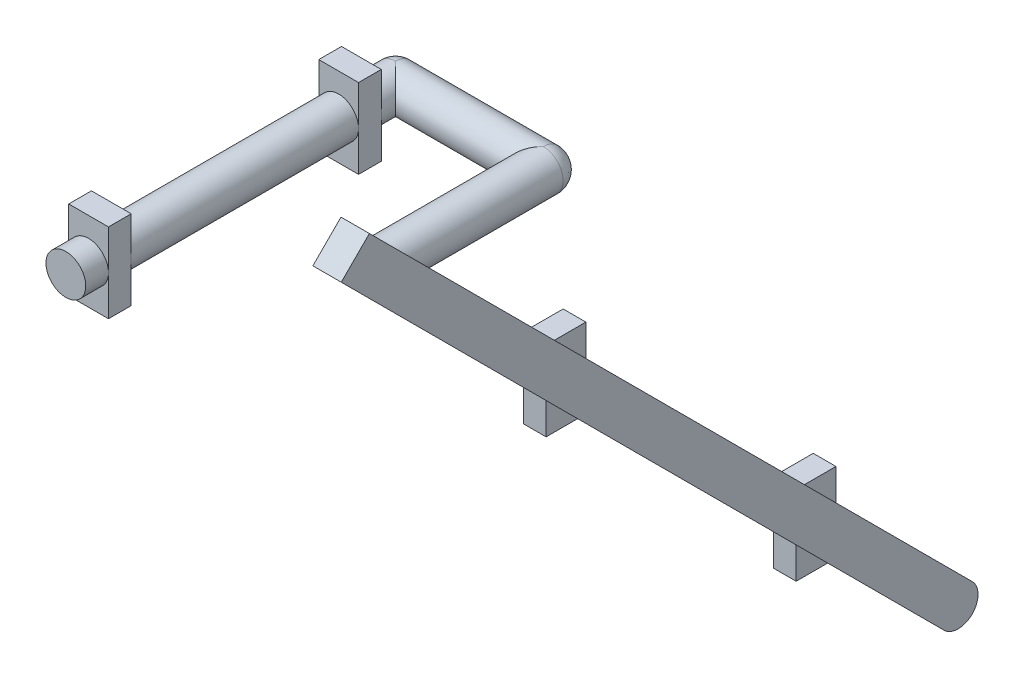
from build123d import *
from build123d.topology import SkipClean

# Parameters (mm, degrees)
ESQUISSE1_R       = 3.5
EXTRUSION1_DEPTH  = 20
ESQUISSE2_W       = 7
ESQUISSE2_H       = 14
EXTRUSION2_DEPTH  = 4
ESQUISSE3_R       = 3.5
EXTRUSION3_DEPTH  = 4
EXTRUSION4_START  = 6
ESQUISSE4_R       = 3.5
EXTRUSION4_DEPTH  = 6
ESQUISSE5_R       = 3.5
EXTRUSION5_DEPTH  = 26
ESQUISSE6_W       = 3.5
ESQUISSE6_H       = 30
ESQUISSE7_W       = 30
ESQUISSE7_H       = 3.5
ESQUISSE8_W       = 7
ESQUISSE8_H       = 14
EXTRUSION6_DEPTH  = 4
EXTRUSION7_DEPTH  = 40
EXTRUSION8_DEPTH  = 4
ESQUISSE11_R      = 3.5
EXTRUSION9_DEPTH  = 20
EXTRUSION10_DEPTH = 5


with BuildPart() as part:
    # Esquisse1 → Extrusion1 (new body)
    with BuildSketch(Plane.XY):
        Circle(ESQUISSE1_R)
    extrusion1 = extrude(amount=EXTRUSION1_DEPTH)

    # Esquisse2 → Extrusion2 (add)
    with BuildSketch(Plane.XY.offset(20)):
        Rectangle(ESQUISSE2_W, ESQUISSE2_H)
    extrusion2 = extrude(amount=EXTRUSION2_DEPTH)

    # Esquisse3 → Extrusion3 (add)
    with BuildSketch(Plane.XY.offset(24)):
        Circle(ESQUISSE3_R)
    extrude(amount=EXTRUSION3_DEPTH)

    # Sym_trie1: Extrusion1, Extrusion2 across plane
    add(extrusion1.mirror(Plane.XY))
    add(extrusion2.mirror(Plane.XY))

    # Esquisse4 → Extrusion4 (add)
    with BuildSketch(Plane(origin=(0, 0, -24), x_dir=(-1, 0, 0), z_dir=(0, 0, -1)).offset(EXTRUSION4_START)):
        Circle(ESQUISSE4_R)
    extrude(amount=-EXTRUSION4_DEPTH)

    # Esquisse5 → Extrusion5 (add)
    with BuildSketch(Plane(origin=(0, 0, 0), x_dir=(0, 0, -1), z_dir=(1, 0, 0))):
        with Locations(Location((30, 0, 0), (0, 0, 180))):
            Circle(ESQUISSE5_R)
    extrude(amount=EXTRUSION5_DEPTH)

    # Esquisse6 → R_volution1 (revolve)
    with BuildSketch(Plane(origin=(0, 0, 0), x_dir=(1, 0, 0), z_dir=(0, 1, 0)), mode=Mode.PRIVATE) as r_volution1_sk:
        with Locations((27.75, 15)):
            Rectangle(ESQUISSE6_W, ESQUISSE6_H)
    revolve(r_volution1_sk.sketch.rotate(Axis((26, 0, -30), (0, 0, 1)), 180), axis=Axis((26, 0, -30), (0, 0, 1)))

    # Esquisse7 → R_volution2 (revolve)
    with BuildSketch(Plane(origin=(0, 0, 0), x_dir=(1, 0, 0), z_dir=(0, 1, 0))):
        with Locations((41, -1.75)):
            Rectangle(ESQUISSE7_W, ESQUISSE7_H)
    revolve(axis=Axis((26, 0, 0), (1, 0, 0)))

    # Esquisse8 → Extrusion6 (add)
    with BuildSketch(Plane(origin=(56, 0, 0), x_dir=(0, 0, -1), z_dir=(1, 0, 0))):
        Rectangle(ESQUISSE8_W, ESQUISSE8_H)
    extrude(amount=EXTRUSION6_DEPTH)

    # Esquisse9 → Extrusion7 (add)
    with BuildSketch(Plane(origin=(60, 0, 0), x_dir=(0, 0, -1), z_dir=(1, 0, 0))):
        with BuildLine():
            ThreePointArc((-3.5, 0), (0, -3.5), (3.5, 0))
            ThreePointArc((3.5, 0), (0, 3.5), (-3.5, 0))
        make_face()
    extrude(amount=EXTRUSION7_DEPTH)

    # Esquisse10 → Extrusion8 (add)
    with BuildSketch(Plane(origin=(100, 0, 0), x_dir=(0, 0, -1), z_dir=(1, 0, 0))):
        Polygon((3.5, 0), (3.5, 7), (-3.5, 7), (-3.5, 0), (-3.5, -7), (3.5, -7), align=None)
    extrude(amount=EXTRUSION8_DEPTH)

    # Esquisse11 → Extrusion9 (add)
    with BuildSketch(Plane(origin=(104, 0, 0), x_dir=(0, 0, -1), z_dir=(1, 0, 0))):
        with Locations(Location((0, 0, 0), (0, 0, 180))):
            Circle(ESQUISSE11_R)
    extrude(amount=EXTRUSION9_DEPTH)

    # Esquisse12 → Extrusion10 (add)
    with SkipClean():  # the faces are left unmerged after this step: merging them gives an invalid solid
        with BuildSketch(Plane(origin=(124, 0, 0), x_dir=(0, 0, -1), z_dir=(1, 0, 0))):
            with BuildLine():
                Line((-103.591143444, 108.540890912), (2.474873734, 2.474873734))
                ThreePointArc((2.474873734, 2.474873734), (2.474873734, -2.474873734), (-2.474873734, -2.474873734))
                Line((-2.474873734, -2.474873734), (-108.540890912, 103.591143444))
                Line((-108.540890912, 103.591143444), (-103.591143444, 108.540890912))
            make_face()
        extrude(amount=EXTRUSION10_DEPTH)

    # Esquisse13 → R_volution3 (revolve)
    with SkipClean():  # the faces are left unmerged after this step: merging them gives an invalid solid
        with BuildSketch(Plane(origin=(0, 0, -30), x_dir=(-1, 0, 0), z_dir=(0, 0, -1))):
            with BuildLine():
                Line((0, 3.5), (0, -3.5))
                ThreePointArc((0, -3.5), (3.5, 0), (0, 3.5))
            make_face()
        revolve(axis=Axis((0, -11.338761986, -30), (0, 1, 0)))

    # Esquisse14 → R_volution4 (revolve)
    with SkipClean():  # the faces are left unmerged after this step: merging them gives an invalid solid
        with BuildSketch(Plane(origin=(0, 0, -30), x_dir=(-1, 0, 0), z_dir=(0, 0, -1))):
            with BuildLine():
                Line((-26, -3.5), (-26, 3.5))
                ThreePointArc((-26, 3.5), (-29.5, 0), (-26, -3.5))
            make_face()
        revolve(axis=Axis((26, -11.755991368, -30), (0, 1, 0)))

    # Esquisse15 → R_volution5 (revolve)
    with SkipClean():  # the faces are left unmerged after this step: merging them gives an invalid solid
        with BuildSketch(Plane.XY):
            with BuildLine():
                Line((26, -3.5), (26, 3.5))
                ThreePointArc((26, 3.5), (22.5, 0), (26, -3.5))
            make_face()
        revolve(axis=Axis((26, 9.768028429, 0), (0, -1, 0)))


solid = part.part
